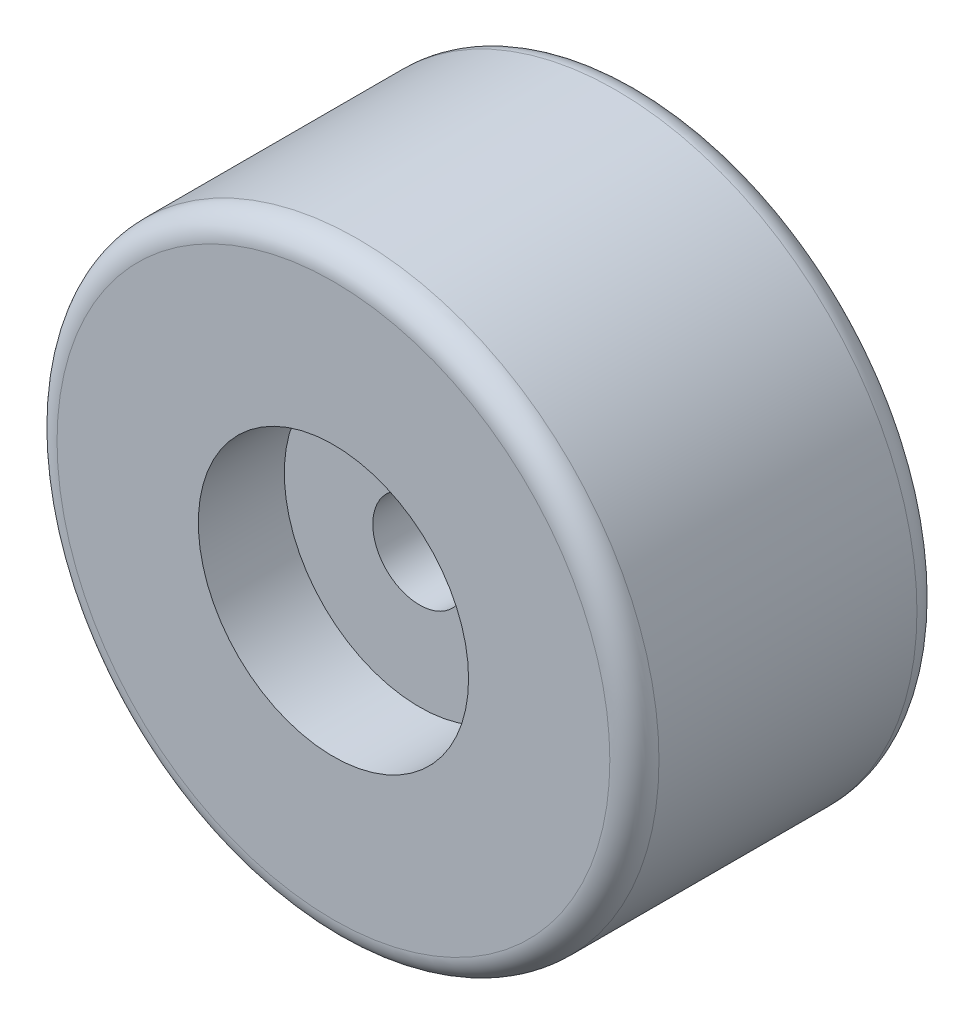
ISO-10303-21;
HEADER;
FILE_DESCRIPTION(('STEP AP214'),'2;1');
FILE_NAME('part.step','',(''),(''),'','','');
FILE_SCHEMA(('AUTOMOTIVE_DESIGN { 1 0 10303 214 1 1 1 1 }'));
ENDSEC;
DATA;
#1=APPLICATION_CONTEXT('core data for automotive mechanical design processes');
#2=APPLICATION_PROTOCOL_DEFINITION('international standard','automotive_design',2000,#1);
#3=PRODUCT_CONTEXT('',#1,'mechanical');
#4=PRODUCT('Part','Part','',(#3));
#5=PRODUCT_RELATED_PRODUCT_CATEGORY('part','',(#4));
#6=PRODUCT_DEFINITION_FORMATION('','',#4);
#7=PRODUCT_DEFINITION_CONTEXT('part definition',#1,'design');
#8=PRODUCT_DEFINITION('design','',#6,#7);
#9=PRODUCT_DEFINITION_SHAPE('','',#8);
#10=(LENGTH_UNIT() NAMED_UNIT(*) SI_UNIT(.MILLI.,.METRE.));
#11=(NAMED_UNIT(*) PLANE_ANGLE_UNIT() SI_UNIT($,.RADIAN.));
#12=(NAMED_UNIT(*) SI_UNIT($,.STERADIAN.) SOLID_ANGLE_UNIT());
#13=UNCERTAINTY_MEASURE_WITH_UNIT(LENGTH_MEASURE(1.E-05),#10,'distance_accuracy_value','');
#14=(GEOMETRIC_REPRESENTATION_CONTEXT(3) GLOBAL_UNCERTAINTY_ASSIGNED_CONTEXT((#13)) GLOBAL_UNIT_ASSIGNED_CONTEXT((#10,
#11,#12)) REPRESENTATION_CONTEXT('',''));
#15=CARTESIAN_POINT('',(0.,0.,0.));
#16=DIRECTION('',(0.,0.,1.));
#17=DIRECTION('',(1.,0.,0.));
#18=AXIS2_PLACEMENT_3D('',#15,#16,#17);
#19=CARTESIAN_POINT('',(0.,0.,31.75));
#20=DIRECTION('',(0.,0.,-1.));
#21=DIRECTION('',(-1.,0.,0.));
#22=AXIS2_PLACEMENT_3D('',#19,#20,#21);
#23=CYLINDRICAL_SURFACE('',#22,4.826);
#24=CARTESIAN_POINT('',(0.,0.,0.));
#25=DIRECTION('',(0.,0.,1.));
#26=DIRECTION('',(1.,0.,0.));
#27=AXIS2_PLACEMENT_3D('',#24,#25,#26);
#28=CIRCLE('',#27,4.826);
#29=CARTESIAN_POINT('',(4.826,0.,0.));
#30=VERTEX_POINT('',#29);
#31=EDGE_CURVE('E54',#30,#30,#28,.T.);
#32=ORIENTED_EDGE('',*,*,#31,.F.);
#33=EDGE_LOOP('',(#32));
#34=FACE_BOUND('',#33,.T.);
#35=CARTESIAN_POINT('',(0.,0.,22.86));
#36=DIRECTION('',(0.,0.,1.));
#37=DIRECTION('',(1.,0.,0.));
#38=AXIS2_PLACEMENT_3D('',#35,#36,#37);
#39=CIRCLE('',#38,4.826);
#40=CARTESIAN_POINT('',(4.826,0.,22.86));
#41=VERTEX_POINT('',#40);
#42=EDGE_CURVE('E38',#41,#41,#39,.T.);
#43=ORIENTED_EDGE('',*,*,#42,.T.);
#44=EDGE_LOOP('',(#43));
#45=FACE_BOUND('',#44,.T.);
#46=ADVANCED_FACE('F34',(#34,#45),#23,.F.);
#47=CARTESIAN_POINT('',(0.,0.,31.75));
#48=DIRECTION('',(0.,0.,1.));
#49=DIRECTION('',(1.,0.,0.));
#50=AXIS2_PLACEMENT_3D('',#47,#48,#49);
#51=PLANE('',#50);
#52=CARTESIAN_POINT('',(0.,0.,31.75));
#53=DIRECTION('',(0.,0.,1.));
#54=DIRECTION('',(1.,0.,0.));
#55=AXIS2_PLACEMENT_3D('',#52,#53,#54);
#56=CIRCLE('',#55,13.97);
#57=CARTESIAN_POINT('',(13.97,0.,31.75));
#58=VERTEX_POINT('',#57);
#59=EDGE_CURVE('E60',#58,#58,#56,.T.);
#60=ORIENTED_EDGE('',*,*,#59,.F.);
#61=EDGE_LOOP('',(#60));
#62=FACE_BOUND('',#61,.T.);
#63=CARTESIAN_POINT('',(0.,0.,31.75));
#64=DIRECTION('',(0.,0.,1.));
#65=DIRECTION('',(1.,0.,0.));
#66=AXIS2_PLACEMENT_3D('',#63,#64,#65);
#67=CIRCLE('',#66,28.575);
#68=CARTESIAN_POINT('',(28.575,0.,31.75));
#69=VERTEX_POINT('',#68);
#70=EDGE_CURVE('E10',#69,#69,#67,.T.);
#71=ORIENTED_EDGE('',*,*,#70,.T.);
#72=EDGE_LOOP('',(#71));
#73=FACE_BOUND('',#72,.T.);
#74=ADVANCED_FACE('F66',(#62,#73),#51,.T.);
#75=CARTESIAN_POINT('',(0.,0.,0.));
#76=DIRECTION('',(0.,0.,1.));
#77=DIRECTION('',(1.,0.,0.));
#78=AXIS2_PLACEMENT_3D('',#75,#76,#77);
#79=PLANE('',#78);
#80=CARTESIAN_POINT('',(0.,0.,0.));
#81=DIRECTION('',(0.,0.,1.));
#82=DIRECTION('',(1.,0.,0.));
#83=AXIS2_PLACEMENT_3D('',#80,#81,#82);
#84=CIRCLE('',#83,28.575);
#85=CARTESIAN_POINT('',(28.575,0.,0.));
#86=VERTEX_POINT('',#85);
#87=EDGE_CURVE('E42',#86,#86,#84,.F.);
#88=ORIENTED_EDGE('',*,*,#87,.T.);
#89=EDGE_LOOP('',(#88));
#90=FACE_BOUND('',#89,.T.);
#91=ORIENTED_EDGE('',*,*,#31,.T.);
#92=EDGE_LOOP('',(#91));
#93=FACE_BOUND('',#92,.T.);
#94=ADVANCED_FACE('F68',(#90,#93),#79,.F.);
#95=CARTESIAN_POINT('',(0.,0.,31.75));
#96=DIRECTION('',(0.,0.,-1.));
#97=DIRECTION('',(-1.,0.,0.));
#98=AXIS2_PLACEMENT_3D('',#95,#96,#97);
#99=CYLINDRICAL_SURFACE('',#98,31.115);
#100=CARTESIAN_POINT('',(0.,0.,2.54));
#101=DIRECTION('',(0.,0.,1.));
#102=DIRECTION('',(1.,0.,0.));
#103=AXIS2_PLACEMENT_3D('',#100,#101,#102);
#104=CIRCLE('',#103,31.115);
#105=CARTESIAN_POINT('',(31.115,0.,2.54));
#106=VERTEX_POINT('',#105);
#107=EDGE_CURVE('E46',#106,#106,#104,.T.);
#108=ORIENTED_EDGE('',*,*,#107,.T.);
#109=EDGE_LOOP('',(#108));
#110=FACE_BOUND('',#109,.T.);
#111=CARTESIAN_POINT('',(0.,0.,29.21));
#112=DIRECTION('',(0.,0.,1.));
#113=DIRECTION('',(1.,0.,0.));
#114=AXIS2_PLACEMENT_3D('',#111,#112,#113);
#115=CIRCLE('',#114,31.115);
#116=CARTESIAN_POINT('',(31.115,0.,29.21));
#117=VERTEX_POINT('',#116);
#118=EDGE_CURVE('E51',#117,#117,#115,.F.);
#119=ORIENTED_EDGE('',*,*,#118,.T.);
#120=EDGE_LOOP('',(#119));
#121=FACE_BOUND('',#120,.T.);
#122=ADVANCED_FACE('F36',(#110,#121),#99,.T.);
#123=CARTESIAN_POINT('',(0.,0.,2.54));
#124=DIRECTION('',(0.,0.,1.));
#125=DIRECTION('',(1.,0.,0.));
#126=AXIS2_PLACEMENT_3D('',#123,#124,#125);
#127=TOROIDAL_SURFACE('',#126,28.575,2.54);
#128=ORIENTED_EDGE('',*,*,#87,.F.);
#129=EDGE_LOOP('',(#128));
#130=FACE_BOUND('',#129,.T.);
#131=ORIENTED_EDGE('',*,*,#107,.F.);
#132=EDGE_LOOP('',(#131));
#133=FACE_BOUND('',#132,.T.);
#134=ADVANCED_FACE('F78',(#130,#133),#127,.T.);
#135=CARTESIAN_POINT('',(0.,0.,29.21));
#136=DIRECTION('',(0.,0.,1.));
#137=DIRECTION('',(1.,0.,0.));
#138=AXIS2_PLACEMENT_3D('',#135,#136,#137);
#139=TOROIDAL_SURFACE('',#138,28.575,2.54);
#140=ORIENTED_EDGE('',*,*,#118,.F.);
#141=EDGE_LOOP('',(#140));
#142=FACE_BOUND('',#141,.T.);
#143=ORIENTED_EDGE('',*,*,#70,.F.);
#144=EDGE_LOOP('',(#143));
#145=FACE_BOUND('',#144,.T.);
#146=ADVANCED_FACE('F81',(#142,#145),#139,.T.);
#147=CARTESIAN_POINT('',(0.,0.,22.86));
#148=DIRECTION('',(0.,0.,1.));
#149=DIRECTION('',(1.,0.,0.));
#150=AXIS2_PLACEMENT_3D('',#147,#148,#149);
#151=CYLINDRICAL_SURFACE('',#150,13.97);
#152=CARTESIAN_POINT('',(0.,0.,22.86));
#153=DIRECTION('',(0.,0.,1.));
#154=DIRECTION('',(1.,0.,0.));
#155=AXIS2_PLACEMENT_3D('',#152,#153,#154);
#156=CIRCLE('',#155,13.97);
#157=CARTESIAN_POINT('',(13.97,0.,22.86));
#158=VERTEX_POINT('',#157);
#159=EDGE_CURVE('E57',#158,#158,#156,.T.);
#160=ORIENTED_EDGE('',*,*,#159,.F.);
#161=EDGE_LOOP('',(#160));
#162=FACE_BOUND('',#161,.T.);
#163=ORIENTED_EDGE('',*,*,#59,.T.);
#164=EDGE_LOOP('',(#163));
#165=FACE_BOUND('',#164,.T.);
#166=ADVANCED_FACE('F64',(#162,#165),#151,.F.);
#167=CARTESIAN_POINT('',(0.,0.,22.86));
#168=DIRECTION('',(0.,0.,1.));
#169=DIRECTION('',(1.,0.,0.));
#170=AXIS2_PLACEMENT_3D('',#167,#168,#169);
#171=PLANE('',#170);
#172=ORIENTED_EDGE('',*,*,#42,.F.);
#173=EDGE_LOOP('',(#172));
#174=FACE_BOUND('',#173,.T.);
#175=ORIENTED_EDGE('',*,*,#159,.T.);
#176=EDGE_LOOP('',(#175));
#177=FACE_BOUND('',#176,.T.);
#178=ADVANCED_FACE('F88',(#174,#177),#171,.T.);
#179=CLOSED_SHELL('',(#46,#74,#94,#122,#134,#146,#166,#178));
#180=MANIFOLD_SOLID_BREP('B2',#179);
#181=ADVANCED_BREP_SHAPE_REPRESENTATION('',(#18,#180),#14);
#182=SHAPE_DEFINITION_REPRESENTATION(#9,#181);
ENDSEC;
END-ISO-10303-21;
